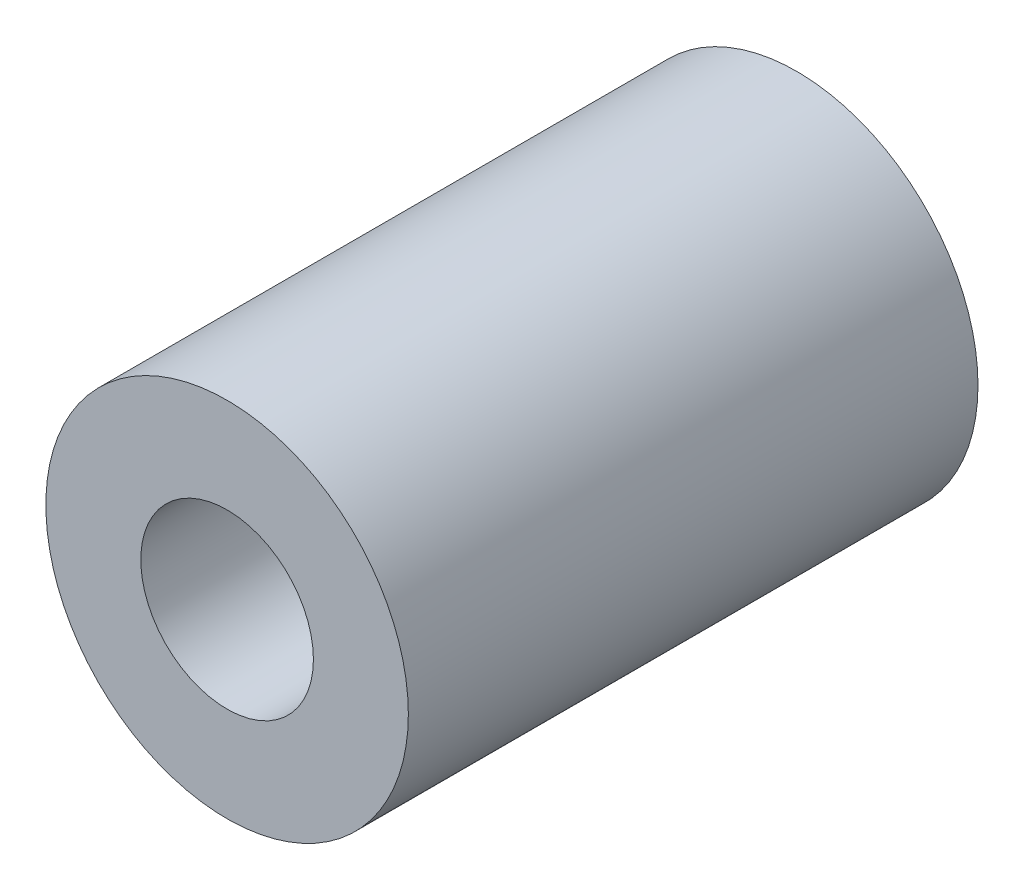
ISO-10303-21;
HEADER;
FILE_DESCRIPTION(('STEP AP214'),'2;1');
FILE_NAME('part.step','',(''),(''),'','','');
FILE_SCHEMA(('AUTOMOTIVE_DESIGN { 1 0 10303 214 1 1 1 1 }'));
ENDSEC;
DATA;
#1=APPLICATION_CONTEXT('core data for automotive mechanical design processes');
#2=APPLICATION_PROTOCOL_DEFINITION('international standard','automotive_design',2000,#1);
#3=PRODUCT_CONTEXT('',#1,'mechanical');
#4=PRODUCT('Part','Part','',(#3));
#5=PRODUCT_RELATED_PRODUCT_CATEGORY('part','',(#4));
#6=PRODUCT_DEFINITION_FORMATION('','',#4);
#7=PRODUCT_DEFINITION_CONTEXT('part definition',#1,'design');
#8=PRODUCT_DEFINITION('design','',#6,#7);
#9=PRODUCT_DEFINITION_SHAPE('','',#8);
#10=(LENGTH_UNIT() NAMED_UNIT(*) SI_UNIT(.MILLI.,.METRE.));
#11=(NAMED_UNIT(*) PLANE_ANGLE_UNIT() SI_UNIT($,.RADIAN.));
#12=(NAMED_UNIT(*) SI_UNIT($,.STERADIAN.) SOLID_ANGLE_UNIT());
#13=UNCERTAINTY_MEASURE_WITH_UNIT(LENGTH_MEASURE(1.E-05),#10,'distance_accuracy_value','');
#14=(GEOMETRIC_REPRESENTATION_CONTEXT(3) GLOBAL_UNCERTAINTY_ASSIGNED_CONTEXT((#13)) GLOBAL_UNIT_ASSIGNED_CONTEXT((#10,
#11,#12)) REPRESENTATION_CONTEXT('',''));
#15=CARTESIAN_POINT('',(0.,0.,0.));
#16=DIRECTION('',(0.,0.,1.));
#17=DIRECTION('',(1.,0.,0.));
#18=AXIS2_PLACEMENT_3D('',#15,#16,#17);
#19=CARTESIAN_POINT('',(0.,0.,33.));
#20=DIRECTION('',(0.,0.,1.));
#21=DIRECTION('',(1.,0.,0.));
#22=AXIS2_PLACEMENT_3D('',#19,#20,#21);
#23=PLANE('',#22);
#24=CARTESIAN_POINT('',(0.,0.,33.));
#25=DIRECTION('',(0.,0.,1.));
#26=DIRECTION('',(1.,0.,0.));
#27=AXIS2_PLACEMENT_3D('',#24,#25,#26);
#28=CIRCLE('',#27,10.5);
#29=CARTESIAN_POINT('',(10.5,0.,33.));
#30=VERTEX_POINT('',#29);
#31=EDGE_CURVE('E10',#30,#30,#28,.T.);
#32=ORIENTED_EDGE('',*,*,#31,.T.);
#33=EDGE_LOOP('',(#32));
#34=FACE_BOUND('',#33,.T.);
#35=CARTESIAN_POINT('',(0.,0.,33.));
#36=DIRECTION('',(0.,0.,1.));
#37=DIRECTION('',(1.,0.,0.));
#38=AXIS2_PLACEMENT_3D('',#35,#36,#37);
#39=CIRCLE('',#38,5.);
#40=CARTESIAN_POINT('',(5.,0.,33.));
#41=VERTEX_POINT('',#40);
#42=EDGE_CURVE('E41',#41,#41,#39,.T.);
#43=ORIENTED_EDGE('',*,*,#42,.F.);
#44=EDGE_LOOP('',(#43));
#45=FACE_BOUND('',#44,.T.);
#46=ADVANCED_FACE('F30',(#34,#45),#23,.T.);
#47=CARTESIAN_POINT('',(0.,0.,0.));
#48=DIRECTION('',(0.,0.,1.));
#49=DIRECTION('',(1.,0.,0.));
#50=AXIS2_PLACEMENT_3D('',#47,#48,#49);
#51=PLANE('',#50);
#52=CARTESIAN_POINT('',(0.,0.,0.));
#53=DIRECTION('',(0.,0.,1.));
#54=DIRECTION('',(1.,0.,0.));
#55=AXIS2_PLACEMENT_3D('',#52,#53,#54);
#56=CIRCLE('',#55,10.5);
#57=CARTESIAN_POINT('',(10.5,0.,0.));
#58=VERTEX_POINT('',#57);
#59=EDGE_CURVE('E34',#58,#58,#56,.T.);
#60=ORIENTED_EDGE('',*,*,#59,.F.);
#61=EDGE_LOOP('',(#60));
#62=FACE_BOUND('',#61,.T.);
#63=CARTESIAN_POINT('',(0.,0.,0.));
#64=DIRECTION('',(0.,0.,1.));
#65=DIRECTION('',(1.,0.,0.));
#66=AXIS2_PLACEMENT_3D('',#63,#64,#65);
#67=CIRCLE('',#66,5.);
#68=CARTESIAN_POINT('',(5.,0.,0.));
#69=VERTEX_POINT('',#68);
#70=EDGE_CURVE('E43',#69,#69,#67,.T.);
#71=ORIENTED_EDGE('',*,*,#70,.T.);
#72=EDGE_LOOP('',(#71));
#73=FACE_BOUND('',#72,.T.);
#74=ADVANCED_FACE('F53',(#62,#73),#51,.F.);
#75=CARTESIAN_POINT('',(0.,0.,33.));
#76=DIRECTION('',(0.,0.,-1.));
#77=DIRECTION('',(-1.,0.,0.));
#78=AXIS2_PLACEMENT_3D('',#75,#76,#77);
#79=CYLINDRICAL_SURFACE('',#78,10.5);
#80=ORIENTED_EDGE('',*,*,#31,.F.);
#81=EDGE_LOOP('',(#80));
#82=FACE_BOUND('',#81,.T.);
#83=ORIENTED_EDGE('',*,*,#59,.T.);
#84=EDGE_LOOP('',(#83));
#85=FACE_BOUND('',#84,.T.);
#86=ADVANCED_FACE('F32',(#82,#85),#79,.T.);
#87=CARTESIAN_POINT('',(0.,0.,33.));
#88=DIRECTION('',(0.,0.,-1.));
#89=DIRECTION('',(-1.,0.,0.));
#90=AXIS2_PLACEMENT_3D('',#87,#88,#89);
#91=CYLINDRICAL_SURFACE('',#90,5.);
#92=ORIENTED_EDGE('',*,*,#42,.T.);
#93=EDGE_LOOP('',(#92));
#94=FACE_BOUND('',#93,.T.);
#95=ORIENTED_EDGE('',*,*,#70,.F.);
#96=EDGE_LOOP('',(#95));
#97=FACE_BOUND('',#96,.T.);
#98=ADVANCED_FACE('F49',(#94,#97),#91,.F.);
#99=CLOSED_SHELL('',(#46,#74,#86,#98));
#100=MANIFOLD_SOLID_BREP('B2',#99);
#101=ADVANCED_BREP_SHAPE_REPRESENTATION('',(#18,#100),#14);
#102=SHAPE_DEFINITION_REPRESENTATION(#9,#101);
ENDSEC;
END-ISO-10303-21;
